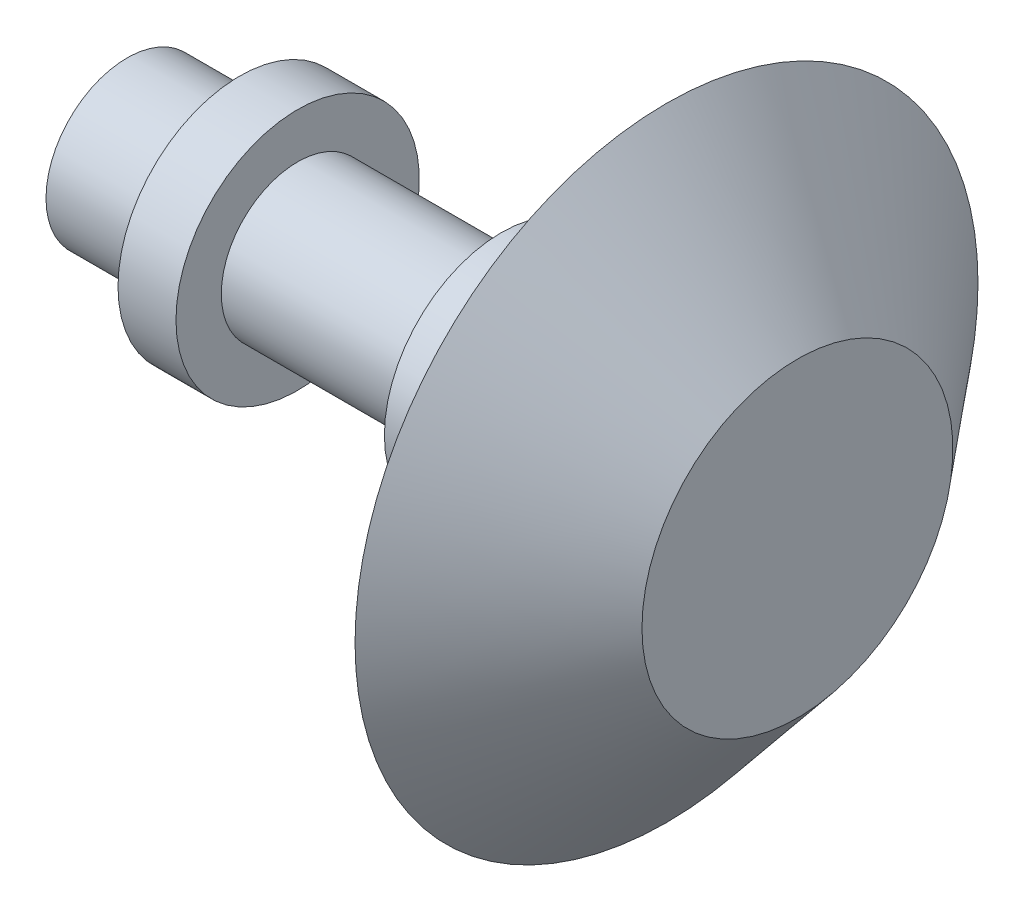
ISO-10303-21;
HEADER;
FILE_DESCRIPTION(('STEP AP214'),'2;1');
FILE_NAME('part.step','',(''),(''),'','','');
FILE_SCHEMA(('AUTOMOTIVE_DESIGN { 1 0 10303 214 1 1 1 1 }'));
ENDSEC;
DATA;
#1=APPLICATION_CONTEXT('core data for automotive mechanical design processes');
#2=APPLICATION_PROTOCOL_DEFINITION('international standard','automotive_design',2000,#1);
#3=PRODUCT_CONTEXT('',#1,'mechanical');
#4=PRODUCT('Part','Part','',(#3));
#5=PRODUCT_RELATED_PRODUCT_CATEGORY('part','',(#4));
#6=PRODUCT_DEFINITION_FORMATION('','',#4);
#7=PRODUCT_DEFINITION_CONTEXT('part definition',#1,'design');
#8=PRODUCT_DEFINITION('design','',#6,#7);
#9=PRODUCT_DEFINITION_SHAPE('','',#8);
#10=(LENGTH_UNIT() NAMED_UNIT(*) SI_UNIT(.MILLI.,.METRE.));
#11=(NAMED_UNIT(*) PLANE_ANGLE_UNIT() SI_UNIT($,.RADIAN.));
#12=(NAMED_UNIT(*) SI_UNIT($,.STERADIAN.) SOLID_ANGLE_UNIT());
#13=UNCERTAINTY_MEASURE_WITH_UNIT(LENGTH_MEASURE(1.E-05),#10,'distance_accuracy_value','');
#14=(GEOMETRIC_REPRESENTATION_CONTEXT(3) GLOBAL_UNCERTAINTY_ASSIGNED_CONTEXT((#13)) GLOBAL_UNIT_ASSIGNED_CONTEXT((#10,
#11,#12)) REPRESENTATION_CONTEXT('',''));
#15=CARTESIAN_POINT('',(0.,0.,0.));
#16=DIRECTION('',(0.,0.,1.));
#17=DIRECTION('',(1.,0.,0.));
#18=AXIS2_PLACEMENT_3D('',#15,#16,#17);
#19=CARTESIAN_POINT('',(0.,15.9335793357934,0.));
#20=DIRECTION('',(1.,0.,0.));
#21=DIRECTION('',(0.,0.,-1.));
#22=AXIS2_PLACEMENT_3D('',#19,#20,#21);
#23=PLANE('',#22);
#24=CARTESIAN_POINT('',(0.,0.,0.));
#25=DIRECTION('',(-1.,0.,0.));
#26=DIRECTION('',(0.,0.,1.));
#27=AXIS2_PLACEMENT_3D('',#24,#25,#26);
#28=CIRCLE('',#27,15.9335793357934);
#29=CARTESIAN_POINT('',(0.,0.,15.9335793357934));
#30=VERTEX_POINT('',#29);
#31=EDGE_CURVE('E10',#30,#30,#28,.T.);
#32=ORIENTED_EDGE('',*,*,#31,.T.);
#33=EDGE_LOOP('',(#32));
#34=FACE_BOUND('',#33,.T.);
#35=ADVANCED_FACE('F346',(#34),#23,.F.);
#36=CARTESIAN_POINT('',(0.,0.,0.));
#37=DIRECTION('',(-1.,0.,0.));
#38=DIRECTION('',(0.,0.,1.));
#39=AXIS2_PLACEMENT_3D('',#36,#37,#38);
#40=CYLINDRICAL_SURFACE('',#39,15.9335793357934);
#41=ORIENTED_EDGE('',*,*,#31,.F.);
#42=EDGE_LOOP('',(#41));
#43=FACE_BOUND('',#42,.T.);
#44=CARTESIAN_POINT('',(22.1078413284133,0.,0.));
#45=DIRECTION('',(-1.,0.,0.));
#46=DIRECTION('',(0.,0.,1.));
#47=AXIS2_PLACEMENT_3D('',#44,#45,#46);
#48=CIRCLE('',#47,15.9335793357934);
#49=CARTESIAN_POINT('',(22.1078413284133,0.,15.9335793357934));
#50=VERTEX_POINT('',#49);
#51=EDGE_CURVE('E352',#50,#50,#48,.T.);
#52=ORIENTED_EDGE('',*,*,#51,.T.);
#53=EDGE_LOOP('',(#52));
#54=FACE_BOUND('',#53,.T.);
#55=ADVANCED_FACE('F402',(#43,#54),#40,.T.);
#56=CARTESIAN_POINT('',(22.1078413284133,23.9003690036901,0.));
#57=DIRECTION('',(1.,0.,0.));
#58=DIRECTION('',(0.,0.,-1.));
#59=AXIS2_PLACEMENT_3D('',#56,#57,#58);
#60=PLANE('',#59);
#61=ORIENTED_EDGE('',*,*,#51,.F.);
#62=EDGE_LOOP('',(#61));
#63=FACE_BOUND('',#62,.T.);
#64=CARTESIAN_POINT('',(22.1078413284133,0.,0.));
#65=DIRECTION('',(-1.,0.,0.));
#66=DIRECTION('',(0.,0.,1.));
#67=AXIS2_PLACEMENT_3D('',#64,#65,#66);
#68=CIRCLE('',#67,23.9003690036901);
#69=CARTESIAN_POINT('',(22.1078413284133,0.,23.9003690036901));
#70=VERTEX_POINT('',#69);
#71=EDGE_CURVE('E356',#70,#70,#68,.T.);
#72=ORIENTED_EDGE('',*,*,#71,.T.);
#73=EDGE_LOOP('',(#72));
#74=FACE_BOUND('',#73,.T.);
#75=ADVANCED_FACE('F406',(#63,#74),#60,.F.);
#76=CARTESIAN_POINT('',(0.,0.,0.));
#77=DIRECTION('',(-1.,0.,0.));
#78=DIRECTION('',(0.,0.,1.));
#79=AXIS2_PLACEMENT_3D('',#76,#77,#78);
#80=CYLINDRICAL_SURFACE('',#79,23.9003690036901);
#81=ORIENTED_EDGE('',*,*,#71,.F.);
#82=EDGE_LOOP('',(#81));
#83=FACE_BOUND('',#82,.T.);
#84=CARTESIAN_POINT('',(33.4936346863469,0.,0.));
#85=DIRECTION('',(-1.,0.,0.));
#86=DIRECTION('',(0.,0.,1.));
#87=AXIS2_PLACEMENT_3D('',#84,#85,#86);
#88=CIRCLE('',#87,23.9003690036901);
#89=CARTESIAN_POINT('',(33.4936346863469,0.,23.9003690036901));
#90=VERTEX_POINT('',#89);
#91=EDGE_CURVE('E360',#90,#90,#88,.T.);
#92=ORIENTED_EDGE('',*,*,#91,.T.);
#93=EDGE_LOOP('',(#92));
#94=FACE_BOUND('',#93,.T.);
#95=ADVANCED_FACE('F411',(#83,#94),#80,.T.);
#96=CARTESIAN_POINT('',(33.4936346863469,15.,0.));
#97=DIRECTION('',(-1.,0.,0.));
#98=DIRECTION('',(0.,0.,1.));
#99=AXIS2_PLACEMENT_3D('',#96,#97,#98);
#100=PLANE('',#99);
#101=ORIENTED_EDGE('',*,*,#91,.F.);
#102=EDGE_LOOP('',(#101));
#103=FACE_BOUND('',#102,.T.);
#104=CARTESIAN_POINT('',(33.4936346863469,0.,0.));
#105=DIRECTION('',(-1.,0.,0.));
#106=DIRECTION('',(0.,0.,1.));
#107=AXIS2_PLACEMENT_3D('',#104,#105,#106);
#108=CIRCLE('',#107,15.);
#109=CARTESIAN_POINT('',(33.4936346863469,0.,15.));
#110=VERTEX_POINT('',#109);
#111=EDGE_CURVE('E365',#110,#110,#108,.T.);
#112=ORIENTED_EDGE('',*,*,#111,.T.);
#113=EDGE_LOOP('',(#112));
#114=FACE_BOUND('',#113,.T.);
#115=ADVANCED_FACE('F417',(#103,#114),#100,.F.);
#116=CARTESIAN_POINT('',(0.,0.,0.));
#117=DIRECTION('',(-1.,0.,0.));
#118=DIRECTION('',(0.,0.,1.));
#119=AXIS2_PLACEMENT_3D('',#116,#117,#118);
#120=CYLINDRICAL_SURFACE('',#119,15.);
#121=ORIENTED_EDGE('',*,*,#111,.F.);
#122=EDGE_LOOP('',(#121));
#123=FACE_BOUND('',#122,.T.);
#124=CARTESIAN_POINT('',(73.4936346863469,0.,0.));
#125=DIRECTION('',(-1.,0.,0.));
#126=DIRECTION('',(0.,0.,1.));
#127=AXIS2_PLACEMENT_3D('',#124,#125,#126);
#128=CIRCLE('',#127,15.);
#129=CARTESIAN_POINT('',(73.4936346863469,0.,15.));
#130=VERTEX_POINT('',#129);
#131=EDGE_CURVE('E368',#130,#130,#128,.T.);
#132=ORIENTED_EDGE('',*,*,#131,.T.);
#133=EDGE_LOOP('',(#132));
#134=FACE_BOUND('',#133,.T.);
#135=ADVANCED_FACE('F421',(#123,#134),#120,.T.);
#136=CARTESIAN_POINT('',(73.4936346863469,22.9667896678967,0.));
#137=DIRECTION('',(1.,0.,0.));
#138=DIRECTION('',(0.,0.,-1.));
#139=AXIS2_PLACEMENT_3D('',#136,#137,#138);
#140=PLANE('',#139);
#141=ORIENTED_EDGE('',*,*,#131,.F.);
#142=EDGE_LOOP('',(#141));
#143=FACE_BOUND('',#142,.T.);
#144=CARTESIAN_POINT('',(73.4936346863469,0.,0.));
#145=DIRECTION('',(-1.,0.,0.));
#146=DIRECTION('',(0.,0.,1.));
#147=AXIS2_PLACEMENT_3D('',#144,#145,#146);
#148=CIRCLE('',#147,22.9667896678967);
#149=CARTESIAN_POINT('',(73.4936346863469,0.,22.9667896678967));
#150=VERTEX_POINT('',#149);
#151=EDGE_CURVE('E371',#150,#150,#148,.T.);
#152=ORIENTED_EDGE('',*,*,#151,.T.);
#153=EDGE_LOOP('',(#152));
#154=FACE_BOUND('',#153,.T.);
#155=ADVANCED_FACE('F425',(#143,#154),#140,.F.);
#156=CARTESIAN_POINT('',(0.,0.,0.));
#157=DIRECTION('',(-1.,0.,0.));
#158=DIRECTION('',(0.,0.,1.));
#159=AXIS2_PLACEMENT_3D('',#156,#157,#158);
#160=CYLINDRICAL_SURFACE('',#159,22.9667896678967);
#161=ORIENTED_EDGE('',*,*,#151,.F.);
#162=EDGE_LOOP('',(#161));
#163=FACE_BOUND('',#162,.T.);
#164=CARTESIAN_POINT('',(82.2571033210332,0.,0.));
#165=DIRECTION('',(-1.,0.,0.));
#166=DIRECTION('',(0.,0.,1.));
#167=AXIS2_PLACEMENT_3D('',#164,#165,#166);
#168=CIRCLE('',#167,22.9667896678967);
#169=CARTESIAN_POINT('',(82.2571033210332,0.,22.9667896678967));
#170=VERTEX_POINT('',#169);
#171=EDGE_CURVE('E374',#170,#170,#168,.T.);
#172=ORIENTED_EDGE('',*,*,#171,.T.);
#173=EDGE_LOOP('',(#172));
#174=FACE_BOUND('',#173,.T.);
#175=ADVANCED_FACE('F429',(#163,#174),#160,.T.);
#176=CARTESIAN_POINT('',(82.2571033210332,15.0000000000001,0.));
#177=DIRECTION('',(-1.,0.,0.));
#178=DIRECTION('',(0.,0.,1.));
#179=AXIS2_PLACEMENT_3D('',#176,#177,#178);
#180=PLANE('',#179);
#181=ORIENTED_EDGE('',*,*,#171,.F.);
#182=EDGE_LOOP('',(#181));
#183=FACE_BOUND('',#182,.T.);
#184=CARTESIAN_POINT('',(82.2571033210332,0.,0.));
#185=DIRECTION('',(-1.,0.,0.));
#186=DIRECTION('',(0.,0.,1.));
#187=AXIS2_PLACEMENT_3D('',#184,#185,#186);
#188=CIRCLE('',#187,15.0000000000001);
#189=CARTESIAN_POINT('',(82.2571033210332,0.,15.0000000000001));
#190=VERTEX_POINT('',#189);
#191=EDGE_CURVE('E377',#190,#190,#188,.T.);
#192=ORIENTED_EDGE('',*,*,#191,.T.);
#193=EDGE_LOOP('',(#192));
#194=FACE_BOUND('',#193,.T.);
#195=ADVANCED_FACE('F433',(#183,#194),#180,.F.);
#196=CARTESIAN_POINT('',(0.,0.,0.));
#197=DIRECTION('',(-1.,0.,0.));
#198=DIRECTION('',(0.,0.,1.));
#199=AXIS2_PLACEMENT_3D('',#196,#197,#198);
#200=CYLINDRICAL_SURFACE('',#199,15.0000000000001);
#201=ORIENTED_EDGE('',*,*,#191,.F.);
#202=EDGE_LOOP('',(#201));
#203=FACE_BOUND('',#202,.T.);
#204=CARTESIAN_POINT('',(105.939115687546,0.,0.));
#205=DIRECTION('',(-1.,0.,0.));
#206=DIRECTION('',(0.,0.,1.));
#207=AXIS2_PLACEMENT_3D('',#204,#205,#206);
#208=CIRCLE('',#207,15.0000000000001);
#209=CARTESIAN_POINT('',(105.939115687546,0.,15.0000000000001));
#210=VERTEX_POINT('',#209);
#211=EDGE_CURVE('E380',#210,#210,#208,.T.);
#212=ORIENTED_EDGE('',*,*,#211,.T.);
#213=EDGE_LOOP('',(#212));
#214=FACE_BOUND('',#213,.T.);
#215=ADVANCED_FACE('F437',(#203,#214),#200,.T.);
#216=CARTESIAN_POINT('',(105.939115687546,61.1777078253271,0.));
#217=DIRECTION('',(1.,0.,0.));
#218=DIRECTION('',(0.,0.,-1.));
#219=AXIS2_PLACEMENT_3D('',#216,#217,#218);
#220=PLANE('',#219);
#221=ORIENTED_EDGE('',*,*,#211,.F.);
#222=EDGE_LOOP('',(#221));
#223=FACE_BOUND('',#222,.T.);
#224=CARTESIAN_POINT('',(105.939115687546,0.,0.));
#225=DIRECTION('',(-1.,0.,0.));
#226=DIRECTION('',(0.,0.,1.));
#227=AXIS2_PLACEMENT_3D('',#224,#225,#226);
#228=CIRCLE('',#227,61.1777078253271);
#229=CARTESIAN_POINT('',(105.939115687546,0.,61.1777078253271));
#230=VERTEX_POINT('',#229);
#231=EDGE_CURVE('E383',#230,#230,#228,.T.);
#232=ORIENTED_EDGE('',*,*,#231,.T.);
#233=EDGE_LOOP('',(#232));
#234=FACE_BOUND('',#233,.T.);
#235=ADVANCED_FACE('F398',(#223,#234),#220,.F.);
#236=CARTESIAN_POINT('',(131.651199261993,0.,0.));
#237=DIRECTION('',(-1.,0.,0.));
#238=DIRECTION('',(0.,0.,1.));
#239=AXIS2_PLACEMENT_3D('',#236,#237,#238);
#240=CONICAL_SURFACE('',#239,30.5352398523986,0.872664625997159);
#241=ORIENTED_EDGE('',*,*,#231,.F.);
#242=EDGE_LOOP('',(#241));
#243=FACE_BOUND('',#242,.T.);
#244=CARTESIAN_POINT('',(131.651199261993,0.,0.));
#245=DIRECTION('',(-1.,0.,0.));
#246=DIRECTION('',(0.,0.,1.));
#247=AXIS2_PLACEMENT_3D('',#244,#245,#246);
#248=CIRCLE('',#247,30.5352398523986);
#249=CARTESIAN_POINT('',(131.651199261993,0.,30.5352398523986));
#250=VERTEX_POINT('',#249);
#251=EDGE_CURVE('E386',#250,#250,#248,.T.);
#252=ORIENTED_EDGE('',*,*,#251,.T.);
#253=EDGE_LOOP('',(#252));
#254=FACE_BOUND('',#253,.T.);
#255=ADVANCED_FACE('F390',(#243,#254),#240,.T.);
#256=CARTESIAN_POINT('',(131.651199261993,0.,0.));
#257=DIRECTION('',(-1.,0.,0.));
#258=DIRECTION('',(0.,0.,1.));
#259=AXIS2_PLACEMENT_3D('',#256,#257,#258);
#260=PLANE('',#259);
#261=ORIENTED_EDGE('',*,*,#251,.F.);
#262=EDGE_LOOP('',(#261));
#263=FACE_BOUND('',#262,.T.);
#264=ADVANCED_FACE('F392',(#263),#260,.F.);
#265=CLOSED_SHELL('',(#35,#55,#75,#95,#115,#135,#155,#175,#195,#215,#235,#255,#264));
#266=MANIFOLD_SOLID_BREP('B2',#265);
#267=ADVANCED_BREP_SHAPE_REPRESENTATION('',(#18,#266),#14);
#268=SHAPE_DEFINITION_REPRESENTATION(#9,#267);
ENDSEC;
END-ISO-10303-21;
